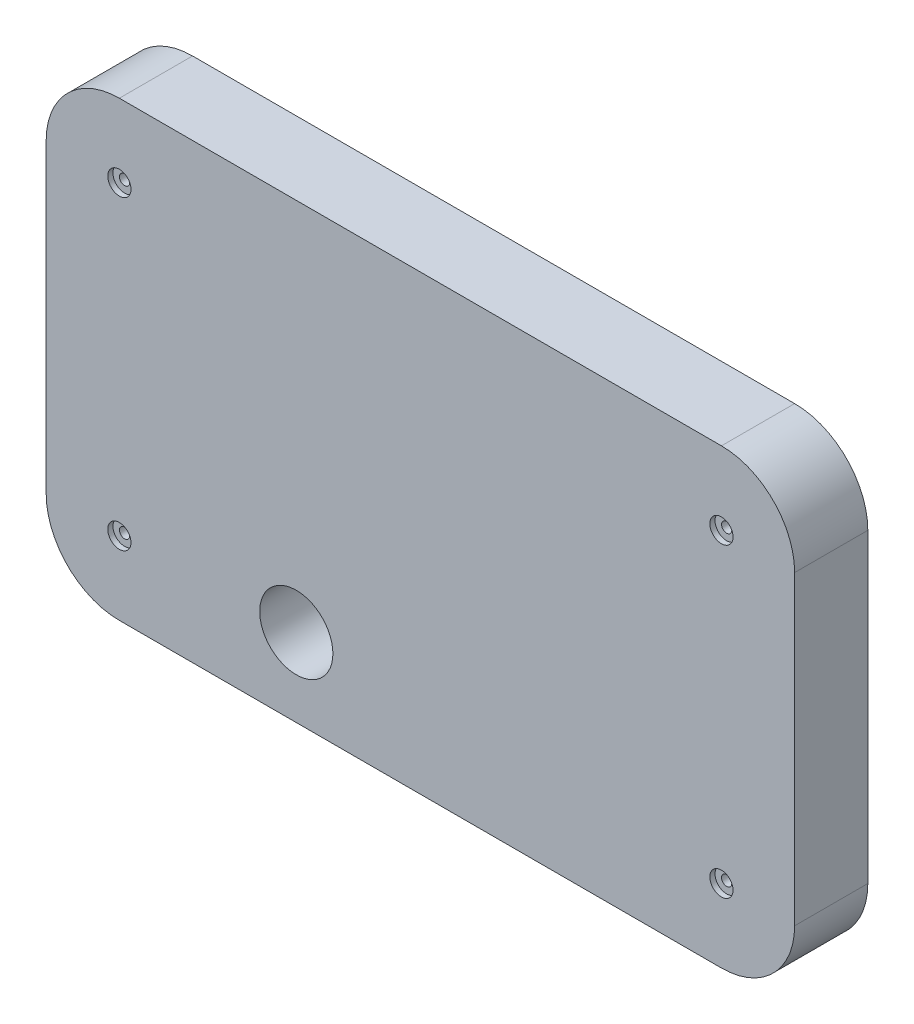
ISO-10303-21;
HEADER;
FILE_DESCRIPTION(('STEP AP214'),'2;1');
FILE_NAME('part.step','',(''),(''),'','','');
FILE_SCHEMA(('AUTOMOTIVE_DESIGN { 1 0 10303 214 1 1 1 1 }'));
ENDSEC;
DATA;
#1=APPLICATION_CONTEXT('core data for automotive mechanical design processes');
#2=APPLICATION_PROTOCOL_DEFINITION('international standard','automotive_design',2000,#1);
#3=PRODUCT_CONTEXT('',#1,'mechanical');
#4=PRODUCT('Part','Part','',(#3));
#5=PRODUCT_RELATED_PRODUCT_CATEGORY('part','',(#4));
#6=PRODUCT_DEFINITION_FORMATION('','',#4);
#7=PRODUCT_DEFINITION_CONTEXT('part definition',#1,'design');
#8=PRODUCT_DEFINITION('design','',#6,#7);
#9=PRODUCT_DEFINITION_SHAPE('','',#8);
#10=(LENGTH_UNIT() NAMED_UNIT(*) SI_UNIT(.MILLI.,.METRE.));
#11=(NAMED_UNIT(*) PLANE_ANGLE_UNIT() SI_UNIT($,.RADIAN.));
#12=(NAMED_UNIT(*) SI_UNIT($,.STERADIAN.) SOLID_ANGLE_UNIT());
#13=UNCERTAINTY_MEASURE_WITH_UNIT(LENGTH_MEASURE(1.E-05),#10,'distance_accuracy_value','');
#14=(GEOMETRIC_REPRESENTATION_CONTEXT(3) GLOBAL_UNCERTAINTY_ASSIGNED_CONTEXT((#13)) GLOBAL_UNIT_ASSIGNED_CONTEXT((#10,
#11,#12)) REPRESENTATION_CONTEXT('',''));
#15=CARTESIAN_POINT('',(0.,0.,0.));
#16=DIRECTION('',(0.,0.,1.));
#17=DIRECTION('',(1.,0.,0.));
#18=AXIS2_PLACEMENT_3D('',#15,#16,#17);
#19=CARTESIAN_POINT('',(10.,51.798753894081,10.));
#20=DIRECTION('',(0.,0.,-1.));
#21=DIRECTION('',(-1.,0.,0.));
#22=AXIS2_PLACEMENT_3D('',#19,#20,#21);
#23=CYLINDRICAL_SURFACE('',#22,10.);
#24=CARTESIAN_POINT('',(10.,51.798753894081,0.));
#25=DIRECTION('',(0.,0.,1.));
#26=DIRECTION('',(1.,0.,0.));
#27=AXIS2_PLACEMENT_3D('',#24,#25,#26);
#28=CIRCLE('',#27,10.);
#29=CARTESIAN_POINT('',(10.0000000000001,61.798753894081,0.));
#30=VERTEX_POINT('',#29);
#31=CARTESIAN_POINT('',(0.,51.7987538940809,0.));
#32=VERTEX_POINT('',#31);
#33=EDGE_CURVE('E101',#30,#32,#28,.T.);
#34=ORIENTED_EDGE('',*,*,#33,.T.);
#35=DIRECTION('',(0.,0.,-1.));
#36=VECTOR('',#35,1.);
#37=CARTESIAN_POINT('',(0.,51.7987538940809,10.));
#38=LINE('',#37,#36);
#39=CARTESIAN_POINT('',(0.,51.7987538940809,10.));
#40=VERTEX_POINT('',#39);
#41=EDGE_CURVE('E11',#40,#32,#38,.T.);
#42=ORIENTED_EDGE('',*,*,#41,.F.);
#43=CARTESIAN_POINT('',(10.,51.798753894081,10.));
#44=DIRECTION('',(0.,0.,1.));
#45=DIRECTION('',(1.,0.,0.));
#46=AXIS2_PLACEMENT_3D('',#43,#44,#45);
#47=CIRCLE('',#46,10.);
#48=CARTESIAN_POINT('',(10.0000000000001,61.798753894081,10.));
#49=VERTEX_POINT('',#48);
#50=EDGE_CURVE('E133',#49,#40,#47,.T.);
#51=ORIENTED_EDGE('',*,*,#50,.F.);
#52=DIRECTION('',(0.,0.,-1.));
#53=VECTOR('',#52,1.);
#54=CARTESIAN_POINT('',(10.0000000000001,61.798753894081,10.));
#55=LINE('',#54,#53);
#56=EDGE_CURVE('E114',#49,#30,#55,.T.);
#57=ORIENTED_EDGE('',*,*,#56,.T.);
#58=EDGE_LOOP('',(#34,#42,#51,#57));
#59=FACE_BOUND('',#58,.T.);
#60=ADVANCED_FACE('F33',(#59),#23,.T.);
#61=CARTESIAN_POINT('',(0.,10.0000000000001,10.));
#62=DIRECTION('',(1.,0.,0.));
#63=DIRECTION('',(0.,0.,-1.));
#64=AXIS2_PLACEMENT_3D('',#61,#62,#63);
#65=PLANE('',#64);
#66=DIRECTION('',(0.,-1.,0.));
#67=VECTOR('',#66,1.);
#68=CARTESIAN_POINT('',(0.,10.0000000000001,0.));
#69=LINE('',#68,#67);
#70=CARTESIAN_POINT('',(0.,10.0000000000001,0.));
#71=VERTEX_POINT('',#70);
#72=EDGE_CURVE('E97',#32,#71,#69,.T.);
#73=ORIENTED_EDGE('',*,*,#72,.T.);
#74=DIRECTION('',(0.,0.,-1.));
#75=VECTOR('',#74,1.);
#76=CARTESIAN_POINT('',(0.,10.0000000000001,10.));
#77=LINE('',#76,#75);
#78=CARTESIAN_POINT('',(0.,10.0000000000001,10.));
#79=VERTEX_POINT('',#78);
#80=EDGE_CURVE('E40',#79,#71,#77,.T.);
#81=ORIENTED_EDGE('',*,*,#80,.F.);
#82=DIRECTION('',(0.,-1.,0.));
#83=VECTOR('',#82,1.);
#84=CARTESIAN_POINT('',(0.,10.0000000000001,10.));
#85=LINE('',#84,#83);
#86=EDGE_CURVE('E110',#40,#79,#85,.T.);
#87=ORIENTED_EDGE('',*,*,#86,.F.);
#88=ORIENTED_EDGE('',*,*,#41,.T.);
#89=EDGE_LOOP('',(#73,#81,#87,#88));
#90=FACE_BOUND('',#89,.T.);
#91=ADVANCED_FACE('F109',(#90),#65,.F.);
#92=CARTESIAN_POINT('',(10.,10.,10.));
#93=DIRECTION('',(0.,0.,-1.));
#94=DIRECTION('',(-1.,0.,0.));
#95=AXIS2_PLACEMENT_3D('',#92,#93,#94);
#96=CYLINDRICAL_SURFACE('',#95,10.);
#97=CARTESIAN_POINT('',(10.,10.,0.));
#98=DIRECTION('',(0.,0.,1.));
#99=DIRECTION('',(1.,0.,0.));
#100=AXIS2_PLACEMENT_3D('',#97,#98,#99);
#101=CIRCLE('',#100,10.);
#102=CARTESIAN_POINT('',(10.0000000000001,0.,0.));
#103=VERTEX_POINT('',#102);
#104=EDGE_CURVE('E103',#71,#103,#101,.T.);
#105=ORIENTED_EDGE('',*,*,#104,.T.);
#106=DIRECTION('',(0.,0.,-1.));
#107=VECTOR('',#106,1.);
#108=CARTESIAN_POINT('',(10.0000000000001,0.,10.));
#109=LINE('',#108,#107);
#110=CARTESIAN_POINT('',(10.0000000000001,0.,10.));
#111=VERTEX_POINT('',#110);
#112=EDGE_CURVE('E159',#111,#103,#109,.T.);
#113=ORIENTED_EDGE('',*,*,#112,.F.);
#114=CARTESIAN_POINT('',(10.,10.,10.));
#115=DIRECTION('',(0.,0.,1.));
#116=DIRECTION('',(1.,0.,0.));
#117=AXIS2_PLACEMENT_3D('',#114,#115,#116);
#118=CIRCLE('',#117,10.);
#119=EDGE_CURVE('E136',#79,#111,#118,.T.);
#120=ORIENTED_EDGE('',*,*,#119,.F.);
#121=ORIENTED_EDGE('',*,*,#80,.T.);
#122=EDGE_LOOP('',(#105,#113,#120,#121));
#123=FACE_BOUND('',#122,.T.);
#124=ADVANCED_FACE('F163',(#123),#96,.T.);
#125=CARTESIAN_POINT('',(10.0000000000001,0.,10.));
#126=DIRECTION('',(0.,1.,0.));
#127=DIRECTION('',(0.,0.,1.));
#128=AXIS2_PLACEMENT_3D('',#125,#126,#127);
#129=PLANE('',#128);
#130=DIRECTION('',(1.,0.,0.));
#131=VECTOR('',#130,1.);
#132=CARTESIAN_POINT('',(10.0000000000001,0.,0.));
#133=LINE('',#132,#131);
#134=CARTESIAN_POINT('',(92.2725856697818,0.,0.));
#135=VERTEX_POINT('',#134);
#136=EDGE_CURVE('E123',#103,#135,#133,.T.);
#137=ORIENTED_EDGE('',*,*,#136,.T.);
#138=DIRECTION('',(0.,0.,-1.));
#139=VECTOR('',#138,1.);
#140=CARTESIAN_POINT('',(92.2725856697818,0.,10.));
#141=LINE('',#140,#139);
#142=CARTESIAN_POINT('',(92.2725856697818,0.,10.));
#143=VERTEX_POINT('',#142);
#144=EDGE_CURVE('E156',#143,#135,#141,.T.);
#145=ORIENTED_EDGE('',*,*,#144,.F.);
#146=DIRECTION('',(1.,0.,0.));
#147=VECTOR('',#146,1.);
#148=CARTESIAN_POINT('',(10.0000000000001,0.,10.));
#149=LINE('',#148,#147);
#150=EDGE_CURVE('E138',#111,#143,#149,.T.);
#151=ORIENTED_EDGE('',*,*,#150,.F.);
#152=ORIENTED_EDGE('',*,*,#112,.T.);
#153=EDGE_LOOP('',(#137,#145,#151,#152));
#154=FACE_BOUND('',#153,.T.);
#155=ADVANCED_FACE('F171',(#154),#129,.F.);
#156=CARTESIAN_POINT('',(92.2725856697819,10.,10.));
#157=DIRECTION('',(0.,0.,-1.));
#158=DIRECTION('',(-1.,0.,0.));
#159=AXIS2_PLACEMENT_3D('',#156,#157,#158);
#160=CYLINDRICAL_SURFACE('',#159,10.);
#161=CARTESIAN_POINT('',(92.2725856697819,10.,0.));
#162=DIRECTION('',(0.,0.,1.));
#163=DIRECTION('',(-1.,0.,0.));
#164=AXIS2_PLACEMENT_3D('',#161,#162,#163);
#165=CIRCLE('',#164,10.);
#166=CARTESIAN_POINT('',(102.272585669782,10.0000000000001,0.));
#167=VERTEX_POINT('',#166);
#168=EDGE_CURVE('E125',#135,#167,#165,.T.);
#169=ORIENTED_EDGE('',*,*,#168,.T.);
#170=DIRECTION('',(0.,0.,-1.));
#171=VECTOR('',#170,1.);
#172=CARTESIAN_POINT('',(102.272585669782,10.0000000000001,10.));
#173=LINE('',#172,#171);
#174=CARTESIAN_POINT('',(102.272585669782,10.0000000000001,10.));
#175=VERTEX_POINT('',#174);
#176=EDGE_CURVE('E153',#175,#167,#173,.T.);
#177=ORIENTED_EDGE('',*,*,#176,.F.);
#178=CARTESIAN_POINT('',(92.2725856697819,10.,10.));
#179=DIRECTION('',(0.,0.,1.));
#180=DIRECTION('',(-1.,0.,0.));
#181=AXIS2_PLACEMENT_3D('',#178,#179,#180);
#182=CIRCLE('',#181,10.);
#183=EDGE_CURVE('E140',#143,#175,#182,.T.);
#184=ORIENTED_EDGE('',*,*,#183,.F.);
#185=ORIENTED_EDGE('',*,*,#144,.T.);
#186=EDGE_LOOP('',(#169,#177,#184,#185));
#187=FACE_BOUND('',#186,.T.);
#188=ADVANCED_FACE('F174',(#187),#160,.T.);
#189=CARTESIAN_POINT('',(102.272585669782,10.0000000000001,10.));
#190=DIRECTION('',(-1.,0.,0.));
#191=DIRECTION('',(0.,0.,1.));
#192=AXIS2_PLACEMENT_3D('',#189,#190,#191);
#193=PLANE('',#192);
#194=DIRECTION('',(0.,1.,0.));
#195=VECTOR('',#194,1.);
#196=CARTESIAN_POINT('',(102.272585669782,10.0000000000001,0.));
#197=LINE('',#196,#195);
#198=CARTESIAN_POINT('',(102.272585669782,51.7987538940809,0.));
#199=VERTEX_POINT('',#198);
#200=EDGE_CURVE('E127',#167,#199,#197,.T.);
#201=ORIENTED_EDGE('',*,*,#200,.T.);
#202=DIRECTION('',(0.,0.,-1.));
#203=VECTOR('',#202,1.);
#204=CARTESIAN_POINT('',(102.272585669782,51.7987538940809,10.));
#205=LINE('',#204,#203);
#206=CARTESIAN_POINT('',(102.272585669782,51.7987538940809,10.));
#207=VERTEX_POINT('',#206);
#208=EDGE_CURVE('E150',#207,#199,#205,.T.);
#209=ORIENTED_EDGE('',*,*,#208,.F.);
#210=DIRECTION('',(0.,1.,0.));
#211=VECTOR('',#210,1.);
#212=CARTESIAN_POINT('',(102.272585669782,10.0000000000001,10.));
#213=LINE('',#212,#211);
#214=EDGE_CURVE('E142',#175,#207,#213,.T.);
#215=ORIENTED_EDGE('',*,*,#214,.F.);
#216=ORIENTED_EDGE('',*,*,#176,.T.);
#217=EDGE_LOOP('',(#201,#209,#215,#216));
#218=FACE_BOUND('',#217,.T.);
#219=ADVANCED_FACE('F179',(#218),#193,.F.);
#220=CARTESIAN_POINT('',(92.2725856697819,51.798753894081,10.));
#221=DIRECTION('',(0.,0.,-1.));
#222=DIRECTION('',(-1.,0.,0.));
#223=AXIS2_PLACEMENT_3D('',#220,#221,#222);
#224=CYLINDRICAL_SURFACE('',#223,9.99999999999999);
#225=CARTESIAN_POINT('',(92.2725856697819,51.798753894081,0.));
#226=DIRECTION('',(0.,0.,1.));
#227=DIRECTION('',(1.,0.,0.));
#228=AXIS2_PLACEMENT_3D('',#225,#226,#227);
#229=CIRCLE('',#228,9.99999999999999);
#230=CARTESIAN_POINT('',(92.2725856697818,61.798753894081,0.));
#231=VERTEX_POINT('',#230);
#232=EDGE_CURVE('E129',#199,#231,#229,.T.);
#233=ORIENTED_EDGE('',*,*,#232,.T.);
#234=DIRECTION('',(0.,0.,-1.));
#235=VECTOR('',#234,1.);
#236=CARTESIAN_POINT('',(92.2725856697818,61.798753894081,10.));
#237=LINE('',#236,#235);
#238=CARTESIAN_POINT('',(92.2725856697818,61.798753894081,10.));
#239=VERTEX_POINT('',#238);
#240=EDGE_CURVE('E147',#239,#231,#237,.T.);
#241=ORIENTED_EDGE('',*,*,#240,.F.);
#242=CARTESIAN_POINT('',(92.2725856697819,51.798753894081,10.));
#243=DIRECTION('',(0.,0.,1.));
#244=DIRECTION('',(1.,0.,0.));
#245=AXIS2_PLACEMENT_3D('',#242,#243,#244);
#246=CIRCLE('',#245,9.99999999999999);
#247=EDGE_CURVE('E52',#207,#239,#246,.T.);
#248=ORIENTED_EDGE('',*,*,#247,.F.);
#249=ORIENTED_EDGE('',*,*,#208,.T.);
#250=EDGE_LOOP('',(#233,#241,#248,#249));
#251=FACE_BOUND('',#250,.T.);
#252=ADVANCED_FACE('F182',(#251),#224,.T.);
#253=CARTESIAN_POINT('',(10.0000000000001,61.798753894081,10.));
#254=DIRECTION('',(0.,-1.,0.));
#255=DIRECTION('',(0.,0.,-1.));
#256=AXIS2_PLACEMENT_3D('',#253,#254,#255);
#257=PLANE('',#256);
#258=DIRECTION('',(-1.,0.,0.));
#259=VECTOR('',#258,1.);
#260=CARTESIAN_POINT('',(10.0000000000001,61.798753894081,0.));
#261=LINE('',#260,#259);
#262=EDGE_CURVE('E131',#231,#30,#261,.T.);
#263=ORIENTED_EDGE('',*,*,#262,.T.);
#264=ORIENTED_EDGE('',*,*,#56,.F.);
#265=DIRECTION('',(-1.,0.,0.));
#266=VECTOR('',#265,1.);
#267=CARTESIAN_POINT('',(10.0000000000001,61.798753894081,10.));
#268=LINE('',#267,#266);
#269=EDGE_CURVE('E47',#239,#49,#268,.T.);
#270=ORIENTED_EDGE('',*,*,#269,.F.);
#271=ORIENTED_EDGE('',*,*,#240,.T.);
#272=EDGE_LOOP('',(#263,#264,#270,#271));
#273=FACE_BOUND('',#272,.T.);
#274=ADVANCED_FACE('F184',(#273),#257,.F.);
#275=CARTESIAN_POINT('',(10.,51.798753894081,10.));
#276=DIRECTION('',(0.,0.,1.));
#277=DIRECTION('',(1.,0.,0.));
#278=AXIS2_PLACEMENT_3D('',#275,#276,#277);
#279=PLANE('',#278);
#280=CARTESIAN_POINT('',(34.176365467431,10.6577665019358,9.99999999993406));
#281=DIRECTION('',(0.,0.,1.));
#282=DIRECTION('',(1.,0.,0.));
#283=AXIS2_PLACEMENT_3D('',#280,#281,#282);
#284=CIRCLE('',#283,5.);
#285=CARTESIAN_POINT('',(39.176365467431,10.6577665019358,9.99999999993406));
#286=VERTEX_POINT('',#285);
#287=EDGE_CURVE('E375',#286,#286,#284,.T.);
#288=ORIENTED_EDGE('',*,*,#287,.F.);
#289=EDGE_LOOP('',(#288));
#290=FACE_BOUND('',#289,.T.);
#291=CARTESIAN_POINT('',(10.,51.798753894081,10.));
#292=DIRECTION('',(0.,0.,1.));
#293=DIRECTION('',(1.,0.,0.));
#294=AXIS2_PLACEMENT_3D('',#291,#292,#293);
#295=CIRCLE('',#294,1.5875);
#296=CARTESIAN_POINT('',(11.5875,51.798753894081,10.));
#297=VERTEX_POINT('',#296);
#298=EDGE_CURVE('E377',#297,#297,#295,.T.);
#299=ORIENTED_EDGE('',*,*,#298,.F.);
#300=EDGE_LOOP('',(#299));
#301=FACE_BOUND('',#300,.T.);
#302=CARTESIAN_POINT('',(92.2725856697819,51.798753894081,10.));
#303=DIRECTION('',(0.,0.,1.));
#304=DIRECTION('',(1.,0.,0.));
#305=AXIS2_PLACEMENT_3D('',#302,#303,#304);
#306=CIRCLE('',#305,1.58749999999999);
#307=CARTESIAN_POINT('',(93.8600856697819,51.798753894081,10.));
#308=VERTEX_POINT('',#307);
#309=EDGE_CURVE('E391',#308,#308,#306,.T.);
#310=ORIENTED_EDGE('',*,*,#309,.F.);
#311=EDGE_LOOP('',(#310));
#312=FACE_BOUND('',#311,.T.);
#313=CARTESIAN_POINT('',(92.2725856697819,10.,10.));
#314=DIRECTION('',(0.,0.,1.));
#315=DIRECTION('',(1.,0.,0.));
#316=AXIS2_PLACEMENT_3D('',#313,#314,#315);
#317=CIRCLE('',#316,1.58749999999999);
#318=CARTESIAN_POINT('',(93.8600856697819,10.,10.));
#319=VERTEX_POINT('',#318);
#320=EDGE_CURVE('E403',#319,#319,#317,.T.);
#321=ORIENTED_EDGE('',*,*,#320,.F.);
#322=EDGE_LOOP('',(#321));
#323=FACE_BOUND('',#322,.T.);
#324=CARTESIAN_POINT('',(10.,10.,10.));
#325=DIRECTION('',(0.,0.,1.));
#326=DIRECTION('',(1.,0.,0.));
#327=AXIS2_PLACEMENT_3D('',#324,#325,#326);
#328=CIRCLE('',#327,1.5875);
#329=CARTESIAN_POINT('',(11.5875,10.,10.));
#330=VERTEX_POINT('',#329);
#331=EDGE_CURVE('E415',#330,#330,#328,.T.);
#332=ORIENTED_EDGE('',*,*,#331,.F.);
#333=EDGE_LOOP('',(#332));
#334=FACE_BOUND('',#333,.T.);
#335=ORIENTED_EDGE('',*,*,#50,.T.);
#336=ORIENTED_EDGE('',*,*,#86,.T.);
#337=ORIENTED_EDGE('',*,*,#119,.T.);
#338=ORIENTED_EDGE('',*,*,#150,.T.);
#339=ORIENTED_EDGE('',*,*,#183,.T.);
#340=ORIENTED_EDGE('',*,*,#214,.T.);
#341=ORIENTED_EDGE('',*,*,#247,.T.);
#342=ORIENTED_EDGE('',*,*,#269,.T.);
#343=EDGE_LOOP('',(#335,#336,#337,#338,#339,#340,#341,#342));
#344=FACE_BOUND('',#343,.T.);
#345=ADVANCED_FACE('F166',(#290,#301,#312,#323,#334,#344),#279,.T.);
#346=CARTESIAN_POINT('',(10.,51.798753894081,0.));
#347=DIRECTION('',(0.,0.,1.));
#348=DIRECTION('',(1.,0.,0.));
#349=AXIS2_PLACEMENT_3D('',#346,#347,#348);
#350=PLANE('',#349);
#351=CARTESIAN_POINT('',(34.176365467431,10.6577665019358,0.));
#352=DIRECTION('',(0.,0.,1.));
#353=DIRECTION('',(1.,0.,0.));
#354=AXIS2_PLACEMENT_3D('',#351,#352,#353);
#355=CIRCLE('',#354,5.);
#356=CARTESIAN_POINT('',(39.176365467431,10.6577665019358,0.));
#357=VERTEX_POINT('',#356);
#358=EDGE_CURVE('E372',#357,#357,#355,.T.);
#359=ORIENTED_EDGE('',*,*,#358,.T.);
#360=EDGE_LOOP('',(#359));
#361=FACE_BOUND('',#360,.T.);
#362=CARTESIAN_POINT('',(10.,51.798753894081,0.));
#363=DIRECTION('',(0.,0.,1.));
#364=DIRECTION('',(1.,0.,0.));
#365=AXIS2_PLACEMENT_3D('',#362,#363,#364);
#366=CIRCLE('',#365,0.698499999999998);
#367=CARTESIAN_POINT('',(10.6985,51.798753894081,0.));
#368=VERTEX_POINT('',#367);
#369=EDGE_CURVE('E388',#368,#368,#366,.T.);
#370=ORIENTED_EDGE('',*,*,#369,.T.);
#371=EDGE_LOOP('',(#370));
#372=FACE_BOUND('',#371,.T.);
#373=CARTESIAN_POINT('',(92.2725856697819,51.798753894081,0.));
#374=DIRECTION('',(0.,0.,1.));
#375=DIRECTION('',(1.,0.,0.));
#376=AXIS2_PLACEMENT_3D('',#373,#374,#375);
#377=CIRCLE('',#376,0.698499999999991);
#378=CARTESIAN_POINT('',(92.9710856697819,51.798753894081,0.));
#379=VERTEX_POINT('',#378);
#380=EDGE_CURVE('E400',#379,#379,#377,.T.);
#381=ORIENTED_EDGE('',*,*,#380,.T.);
#382=EDGE_LOOP('',(#381));
#383=FACE_BOUND('',#382,.T.);
#384=CARTESIAN_POINT('',(92.2725856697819,10.,0.));
#385=DIRECTION('',(0.,0.,1.));
#386=DIRECTION('',(1.,0.,0.));
#387=AXIS2_PLACEMENT_3D('',#384,#385,#386);
#388=CIRCLE('',#387,0.698499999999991);
#389=CARTESIAN_POINT('',(92.9710856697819,10.,0.));
#390=VERTEX_POINT('',#389);
#391=EDGE_CURVE('E412',#390,#390,#388,.T.);
#392=ORIENTED_EDGE('',*,*,#391,.T.);
#393=EDGE_LOOP('',(#392));
#394=FACE_BOUND('',#393,.T.);
#395=CARTESIAN_POINT('',(10.,10.,0.));
#396=DIRECTION('',(0.,0.,1.));
#397=DIRECTION('',(1.,0.,0.));
#398=AXIS2_PLACEMENT_3D('',#395,#396,#397);
#399=CIRCLE('',#398,0.698499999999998);
#400=CARTESIAN_POINT('',(10.6985,10.,0.));
#401=VERTEX_POINT('',#400);
#402=EDGE_CURVE('E115',#401,#401,#399,.T.);
#403=ORIENTED_EDGE('',*,*,#402,.T.);
#404=EDGE_LOOP('',(#403));
#405=FACE_BOUND('',#404,.T.);
#406=ORIENTED_EDGE('',*,*,#33,.F.);
#407=ORIENTED_EDGE('',*,*,#262,.F.);
#408=ORIENTED_EDGE('',*,*,#232,.F.);
#409=ORIENTED_EDGE('',*,*,#200,.F.);
#410=ORIENTED_EDGE('',*,*,#168,.F.);
#411=ORIENTED_EDGE('',*,*,#136,.F.);
#412=ORIENTED_EDGE('',*,*,#104,.F.);
#413=ORIENTED_EDGE('',*,*,#72,.F.);
#414=EDGE_LOOP('',(#406,#407,#408,#409,#410,#411,#412,#413));
#415=FACE_BOUND('',#414,.T.);
#416=ADVANCED_FACE('F98',(#361,#372,#383,#394,#405,#415),#350,.F.);
#417=CARTESIAN_POINT('',(10.,10.,10.));
#418=DIRECTION('',(0.,0.,1.));
#419=DIRECTION('',(1.,0.,0.));
#420=AXIS2_PLACEMENT_3D('',#417,#418,#419);
#421=CYLINDRICAL_SURFACE('',#420,0.698499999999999);
#422=ORIENTED_EDGE('',*,*,#402,.F.);
#423=EDGE_LOOP('',(#422));
#424=FACE_BOUND('',#423,.T.);
#425=CARTESIAN_POINT('',(10.,10.,9.2888));
#426=DIRECTION('',(0.,0.,1.));
#427=DIRECTION('',(1.,0.,0.));
#428=AXIS2_PLACEMENT_3D('',#425,#426,#427);
#429=CIRCLE('',#428,0.698499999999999);
#430=CARTESIAN_POINT('',(10.6985,10.,9.2888));
#431=VERTEX_POINT('',#430);
#432=EDGE_CURVE('E118',#431,#431,#429,.T.);
#433=ORIENTED_EDGE('',*,*,#432,.T.);
#434=EDGE_LOOP('',(#433));
#435=FACE_BOUND('',#434,.T.);
#436=ADVANCED_FACE('F226',(#424,#435),#421,.F.);
#437=CARTESIAN_POINT('',(10.6985,10.,9.2888));
#438=DIRECTION('',(0.,0.,-1.));
#439=DIRECTION('',(-1.,0.,0.));
#440=AXIS2_PLACEMENT_3D('',#437,#438,#439);
#441=PLANE('',#440);
#442=ORIENTED_EDGE('',*,*,#432,.F.);
#443=EDGE_LOOP('',(#442));
#444=FACE_BOUND('',#443,.T.);
#445=CARTESIAN_POINT('',(10.,10.,9.2888));
#446=DIRECTION('',(0.,0.,1.));
#447=DIRECTION('',(1.,0.,0.));
#448=AXIS2_PLACEMENT_3D('',#445,#446,#447);
#449=CIRCLE('',#448,1.5875);
#450=CARTESIAN_POINT('',(11.5875,10.,9.2888));
#451=VERTEX_POINT('',#450);
#452=EDGE_CURVE('E418',#451,#451,#449,.T.);
#453=ORIENTED_EDGE('',*,*,#452,.T.);
#454=EDGE_LOOP('',(#453));
#455=FACE_BOUND('',#454,.T.);
#456=ADVANCED_FACE('F231',(#444,#455),#441,.F.);
#457=CARTESIAN_POINT('',(10.,10.,10.));
#458=DIRECTION('',(0.,0.,1.));
#459=DIRECTION('',(1.,0.,0.));
#460=AXIS2_PLACEMENT_3D('',#457,#458,#459);
#461=CYLINDRICAL_SURFACE('',#460,1.5875);
#462=ORIENTED_EDGE('',*,*,#452,.F.);
#463=EDGE_LOOP('',(#462));
#464=FACE_BOUND('',#463,.T.);
#465=ORIENTED_EDGE('',*,*,#331,.T.);
#466=EDGE_LOOP('',(#465));
#467=FACE_BOUND('',#466,.T.);
#468=ADVANCED_FACE('F243',(#464,#467),#461,.F.);
#469=CARTESIAN_POINT('',(92.2725856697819,10.,10.));
#470=DIRECTION('',(0.,0.,1.));
#471=DIRECTION('',(1.,0.,0.));
#472=AXIS2_PLACEMENT_3D('',#469,#470,#471);
#473=CYLINDRICAL_SURFACE('',#472,0.698499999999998);
#474=ORIENTED_EDGE('',*,*,#391,.F.);
#475=EDGE_LOOP('',(#474));
#476=FACE_BOUND('',#475,.T.);
#477=CARTESIAN_POINT('',(92.2725856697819,10.,9.2888));
#478=DIRECTION('',(0.,0.,1.));
#479=DIRECTION('',(1.,0.,0.));
#480=AXIS2_PLACEMENT_3D('',#477,#478,#479);
#481=CIRCLE('',#480,0.698500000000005);
#482=CARTESIAN_POINT('',(92.9710856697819,10.,9.2888));
#483=VERTEX_POINT('',#482);
#484=EDGE_CURVE('E409',#483,#483,#481,.T.);
#485=ORIENTED_EDGE('',*,*,#484,.T.);
#486=EDGE_LOOP('',(#485));
#487=FACE_BOUND('',#486,.T.);
#488=ADVANCED_FACE('F253',(#476,#487),#473,.F.);
#489=CARTESIAN_POINT('',(92.9710856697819,10.,9.2888));
#490=DIRECTION('',(0.,0.,-1.));
#491=DIRECTION('',(-1.,0.,0.));
#492=AXIS2_PLACEMENT_3D('',#489,#490,#491);
#493=PLANE('',#492);
#494=ORIENTED_EDGE('',*,*,#484,.F.);
#495=EDGE_LOOP('',(#494));
#496=FACE_BOUND('',#495,.T.);
#497=CARTESIAN_POINT('',(92.2725856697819,10.,9.2888));
#498=DIRECTION('',(0.,0.,1.));
#499=DIRECTION('',(1.,0.,0.));
#500=AXIS2_PLACEMENT_3D('',#497,#498,#499);
#501=CIRCLE('',#500,1.58749999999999);
#502=CARTESIAN_POINT('',(93.8600856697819,10.,9.2888));
#503=VERTEX_POINT('',#502);
#504=EDGE_CURVE('E406',#503,#503,#501,.T.);
#505=ORIENTED_EDGE('',*,*,#504,.T.);
#506=EDGE_LOOP('',(#505));
#507=FACE_BOUND('',#506,.T.);
#508=ADVANCED_FACE('F263',(#496,#507),#493,.F.);
#509=CARTESIAN_POINT('',(92.2725856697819,10.,10.));
#510=DIRECTION('',(0.,0.,1.));
#511=DIRECTION('',(1.,0.,0.));
#512=AXIS2_PLACEMENT_3D('',#509,#510,#511);
#513=CYLINDRICAL_SURFACE('',#512,1.58749999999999);
#514=ORIENTED_EDGE('',*,*,#504,.F.);
#515=EDGE_LOOP('',(#514));
#516=FACE_BOUND('',#515,.T.);
#517=ORIENTED_EDGE('',*,*,#320,.T.);
#518=EDGE_LOOP('',(#517));
#519=FACE_BOUND('',#518,.T.);
#520=ADVANCED_FACE('F273',(#516,#519),#513,.F.);
#521=CARTESIAN_POINT('',(92.2725856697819,51.798753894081,10.));
#522=DIRECTION('',(0.,0.,1.));
#523=DIRECTION('',(1.,0.,0.));
#524=AXIS2_PLACEMENT_3D('',#521,#522,#523);
#525=CYLINDRICAL_SURFACE('',#524,0.698499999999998);
#526=ORIENTED_EDGE('',*,*,#380,.F.);
#527=EDGE_LOOP('',(#526));
#528=FACE_BOUND('',#527,.T.);
#529=CARTESIAN_POINT('',(92.2725856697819,51.798753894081,9.2888));
#530=DIRECTION('',(0.,0.,1.));
#531=DIRECTION('',(1.,0.,0.));
#532=AXIS2_PLACEMENT_3D('',#529,#530,#531);
#533=CIRCLE('',#532,0.698500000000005);
#534=CARTESIAN_POINT('',(92.9710856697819,51.798753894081,9.2888));
#535=VERTEX_POINT('',#534);
#536=EDGE_CURVE('E397',#535,#535,#533,.T.);
#537=ORIENTED_EDGE('',*,*,#536,.T.);
#538=EDGE_LOOP('',(#537));
#539=FACE_BOUND('',#538,.T.);
#540=ADVANCED_FACE('F283',(#528,#539),#525,.F.);
#541=CARTESIAN_POINT('',(92.9710856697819,51.798753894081,9.2888));
#542=DIRECTION('',(0.,0.,-1.));
#543=DIRECTION('',(-1.,0.,0.));
#544=AXIS2_PLACEMENT_3D('',#541,#542,#543);
#545=PLANE('',#544);
#546=ORIENTED_EDGE('',*,*,#536,.F.);
#547=EDGE_LOOP('',(#546));
#548=FACE_BOUND('',#547,.T.);
#549=CARTESIAN_POINT('',(92.2725856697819,51.798753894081,9.2888));
#550=DIRECTION('',(0.,0.,1.));
#551=DIRECTION('',(1.,0.,0.));
#552=AXIS2_PLACEMENT_3D('',#549,#550,#551);
#553=CIRCLE('',#552,1.58749999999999);
#554=CARTESIAN_POINT('',(93.8600856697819,51.798753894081,9.2888));
#555=VERTEX_POINT('',#554);
#556=EDGE_CURVE('E394',#555,#555,#553,.T.);
#557=ORIENTED_EDGE('',*,*,#556,.T.);
#558=EDGE_LOOP('',(#557));
#559=FACE_BOUND('',#558,.T.);
#560=ADVANCED_FACE('F293',(#548,#559),#545,.F.);
#561=CARTESIAN_POINT('',(92.2725856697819,51.798753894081,10.));
#562=DIRECTION('',(0.,0.,1.));
#563=DIRECTION('',(1.,0.,0.));
#564=AXIS2_PLACEMENT_3D('',#561,#562,#563);
#565=CYLINDRICAL_SURFACE('',#564,1.58749999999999);
#566=ORIENTED_EDGE('',*,*,#556,.F.);
#567=EDGE_LOOP('',(#566));
#568=FACE_BOUND('',#567,.T.);
#569=ORIENTED_EDGE('',*,*,#309,.T.);
#570=EDGE_LOOP('',(#569));
#571=FACE_BOUND('',#570,.T.);
#572=ADVANCED_FACE('F303',(#568,#571),#565,.F.);
#573=CARTESIAN_POINT('',(10.,51.798753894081,10.));
#574=DIRECTION('',(0.,0.,1.));
#575=DIRECTION('',(1.,0.,0.));
#576=AXIS2_PLACEMENT_3D('',#573,#574,#575);
#577=CYLINDRICAL_SURFACE('',#576,0.698499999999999);
#578=ORIENTED_EDGE('',*,*,#369,.F.);
#579=EDGE_LOOP('',(#578));
#580=FACE_BOUND('',#579,.T.);
#581=CARTESIAN_POINT('',(10.,51.798753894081,9.2888));
#582=DIRECTION('',(0.,0.,1.));
#583=DIRECTION('',(1.,0.,0.));
#584=AXIS2_PLACEMENT_3D('',#581,#582,#583);
#585=CIRCLE('',#584,0.698499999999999);
#586=CARTESIAN_POINT('',(10.6985,51.798753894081,9.2888));
#587=VERTEX_POINT('',#586);
#588=EDGE_CURVE('E385',#587,#587,#585,.T.);
#589=ORIENTED_EDGE('',*,*,#588,.T.);
#590=EDGE_LOOP('',(#589));
#591=FACE_BOUND('',#590,.T.);
#592=ADVANCED_FACE('F313',(#580,#591),#577,.F.);
#593=CARTESIAN_POINT('',(10.6985,51.798753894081,9.2888));
#594=DIRECTION('',(0.,0.,-1.));
#595=DIRECTION('',(-1.,0.,0.));
#596=AXIS2_PLACEMENT_3D('',#593,#594,#595);
#597=PLANE('',#596);
#598=ORIENTED_EDGE('',*,*,#588,.F.);
#599=EDGE_LOOP('',(#598));
#600=FACE_BOUND('',#599,.T.);
#601=CARTESIAN_POINT('',(10.,51.798753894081,9.2888));
#602=DIRECTION('',(0.,0.,1.));
#603=DIRECTION('',(1.,0.,0.));
#604=AXIS2_PLACEMENT_3D('',#601,#602,#603);
#605=CIRCLE('',#604,1.5875);
#606=CARTESIAN_POINT('',(11.5875,51.798753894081,9.2888));
#607=VERTEX_POINT('',#606);
#608=EDGE_CURVE('E382',#607,#607,#605,.T.);
#609=ORIENTED_EDGE('',*,*,#608,.T.);
#610=EDGE_LOOP('',(#609));
#611=FACE_BOUND('',#610,.T.);
#612=ADVANCED_FACE('F323',(#600,#611),#597,.F.);
#613=CARTESIAN_POINT('',(10.,51.798753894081,10.));
#614=DIRECTION('',(0.,0.,1.));
#615=DIRECTION('',(1.,0.,0.));
#616=AXIS2_PLACEMENT_3D('',#613,#614,#615);
#617=CYLINDRICAL_SURFACE('',#616,1.5875);
#618=ORIENTED_EDGE('',*,*,#608,.F.);
#619=EDGE_LOOP('',(#618));
#620=FACE_BOUND('',#619,.T.);
#621=ORIENTED_EDGE('',*,*,#298,.T.);
#622=EDGE_LOOP('',(#621));
#623=FACE_BOUND('',#622,.T.);
#624=ADVANCED_FACE('F333',(#620,#623),#617,.F.);
#625=CARTESIAN_POINT('',(34.176365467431,10.6577665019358,0.));
#626=DIRECTION('',(0.,0.,1.));
#627=DIRECTION('',(1.,0.,0.));
#628=AXIS2_PLACEMENT_3D('',#625,#626,#627);
#629=CYLINDRICAL_SURFACE('',#628,5.);
#630=ORIENTED_EDGE('',*,*,#358,.F.);
#631=EDGE_LOOP('',(#630));
#632=FACE_BOUND('',#631,.T.);
#633=ORIENTED_EDGE('',*,*,#287,.T.);
#634=EDGE_LOOP('',(#633));
#635=FACE_BOUND('',#634,.T.);
#636=ADVANCED_FACE('F343',(#632,#635),#629,.F.);
#637=CLOSED_SHELL('',(#60,#91,#124,#155,#188,#219,#252,#274,#345,#416,#436,#456,#468,#488,#508,
#520,#540,#560,#572,#592,#612,#624,#636));
#638=MANIFOLD_SOLID_BREP('B2',#637);
#639=ADVANCED_BREP_SHAPE_REPRESENTATION('',(#18,#638),#14);
#640=SHAPE_DEFINITION_REPRESENTATION(#9,#639);
ENDSEC;
END-ISO-10303-21;
